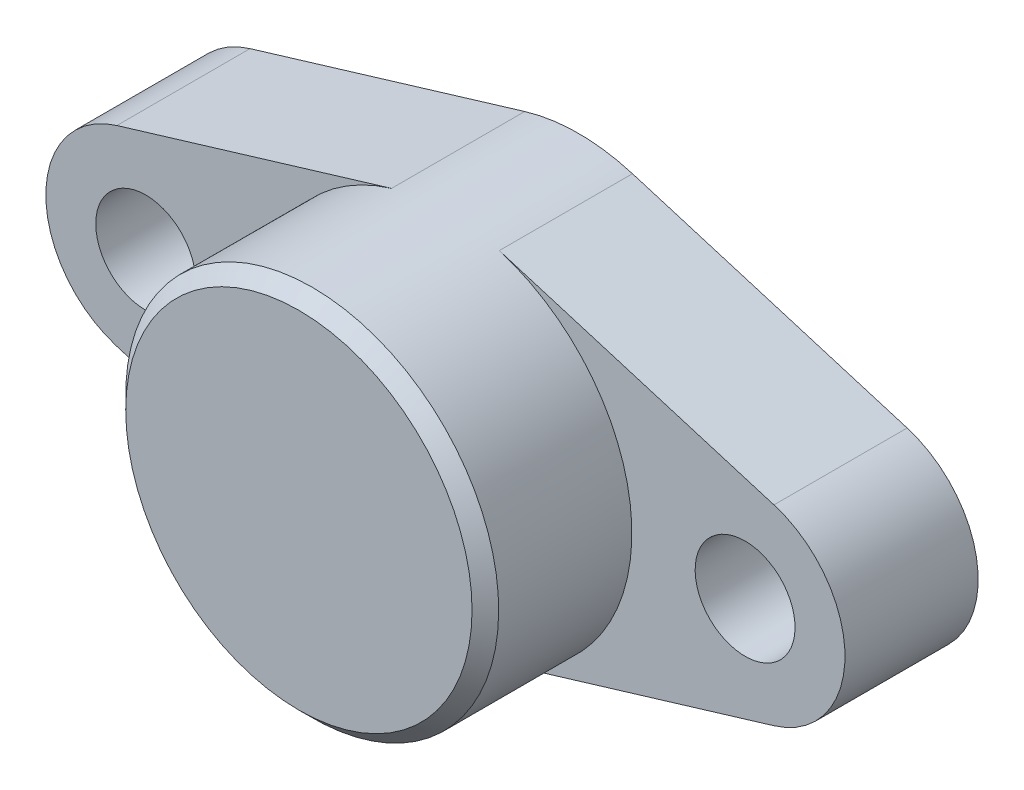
ISO-10303-21;
HEADER;
FILE_DESCRIPTION(('STEP AP214'),'2;1');
FILE_NAME('part.step','',(''),(''),'','','');
FILE_SCHEMA(('AUTOMOTIVE_DESIGN { 1 0 10303 214 1 1 1 1 }'));
ENDSEC;
DATA;
#1=APPLICATION_CONTEXT('core data for automotive mechanical design processes');
#2=APPLICATION_PROTOCOL_DEFINITION('international standard','automotive_design',2000,#1);
#3=PRODUCT_CONTEXT('',#1,'mechanical');
#4=PRODUCT('Part','Part','',(#3));
#5=PRODUCT_RELATED_PRODUCT_CATEGORY('part','',(#4));
#6=PRODUCT_DEFINITION_FORMATION('','',#4);
#7=PRODUCT_DEFINITION_CONTEXT('part definition',#1,'design');
#8=PRODUCT_DEFINITION('design','',#6,#7);
#9=PRODUCT_DEFINITION_SHAPE('','',#8);
#10=(LENGTH_UNIT() NAMED_UNIT(*) SI_UNIT(.MILLI.,.METRE.));
#11=(NAMED_UNIT(*) PLANE_ANGLE_UNIT() SI_UNIT($,.RADIAN.));
#12=(NAMED_UNIT(*) SI_UNIT($,.STERADIAN.) SOLID_ANGLE_UNIT());
#13=UNCERTAINTY_MEASURE_WITH_UNIT(LENGTH_MEASURE(1.E-05),#10,'distance_accuracy_value','');
#14=(GEOMETRIC_REPRESENTATION_CONTEXT(3) GLOBAL_UNCERTAINTY_ASSIGNED_CONTEXT((#13)) GLOBAL_UNIT_ASSIGNED_CONTEXT((#10,
#11,#12)) REPRESENTATION_CONTEXT('',''));
#15=CARTESIAN_POINT('',(0.,0.,0.));
#16=DIRECTION('',(0.,0.,1.));
#17=DIRECTION('',(1.,0.,0.));
#18=AXIS2_PLACEMENT_3D('',#15,#16,#17);
#19=CARTESIAN_POINT('',(22.5,0.,10.));
#20=DIRECTION('',(0.,0.,1.));
#21=DIRECTION('',(0.,1.,0.));
#22=AXIS2_PLACEMENT_3D('',#19,#20,#21);
#23=PLANE('',#22);
#24=CARTESIAN_POINT('',(0.,0.,10.));
#25=DIRECTION('',(0.,0.,1.));
#26=DIRECTION('',(0.,1.,0.));
#27=AXIS2_PLACEMENT_3D('',#24,#25,#26);
#28=CIRCLE('',#27,3.75);
#29=CARTESIAN_POINT('',(0.,3.75,10.));
#30=VERTEX_POINT('',#29);
#31=EDGE_CURVE('E88',#30,#30,#28,.T.);
#32=ORIENTED_EDGE('',*,*,#31,.F.);
#33=EDGE_LOOP('',(#32));
#34=FACE_BOUND('',#33,.T.);
#35=CARTESIAN_POINT('',(22.5,0.,10.));
#36=DIRECTION('',(0.,0.,1.));
#37=DIRECTION('',(0.,1.,0.));
#38=AXIS2_PLACEMENT_3D('',#35,#36,#37);
#39=CIRCLE('',#38,14.);
#40=CARTESIAN_POINT('',(18.4555555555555,13.4030768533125,10.));
#41=VERTEX_POINT('',#40);
#42=CARTESIAN_POINT('',(18.4555555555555,-13.4030768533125,10.));
#43=VERTEX_POINT('',#42);
#44=EDGE_CURVE('E80',#41,#43,#39,.T.);
#45=ORIENTED_EDGE('',*,*,#44,.F.);
#46=DIRECTION('',(0.957362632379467,0.288888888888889,0.));
#47=VECTOR('',#46,1.);
#48=CARTESIAN_POINT('',(-2.16666666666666,7.18021974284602,10.));
#49=LINE('',#48,#47);
#50=CARTESIAN_POINT('',(-2.16666666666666,7.18021974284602,10.));
#51=VERTEX_POINT('',#50);
#52=EDGE_CURVE('E82',#51,#41,#49,.T.);
#53=ORIENTED_EDGE('',*,*,#52,.F.);
#54=CARTESIAN_POINT('',(0.,0.,10.));
#55=DIRECTION('',(0.,0.,1.));
#56=DIRECTION('',(0.,1.,0.));
#57=AXIS2_PLACEMENT_3D('',#54,#55,#56);
#58=CIRCLE('',#57,7.5);
#59=CARTESIAN_POINT('',(-2.16666666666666,-7.18021974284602,10.));
#60=VERTEX_POINT('',#59);
#61=EDGE_CURVE('E99',#51,#60,#58,.T.);
#62=ORIENTED_EDGE('',*,*,#61,.T.);
#63=DIRECTION('',(0.957362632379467,-0.288888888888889,0.));
#64=VECTOR('',#63,1.);
#65=CARTESIAN_POINT('',(-2.16666666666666,-7.18021974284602,10.));
#66=LINE('',#65,#64);
#67=EDGE_CURVE('E84',#60,#43,#66,.T.);
#68=ORIENTED_EDGE('',*,*,#67,.T.);
#69=EDGE_LOOP('',(#45,#53,#62,#68));
#70=FACE_BOUND('',#69,.T.);
#71=ADVANCED_FACE('F14',(#34,#70),#23,.T.);
#72=CARTESIAN_POINT('',(45.,0.,10.));
#73=DIRECTION('',(0.,0.,1.));
#74=DIRECTION('',(0.,1.,0.));
#75=AXIS2_PLACEMENT_3D('',#72,#73,#74);
#76=CIRCLE('',#75,3.75);
#77=CARTESIAN_POINT('',(45.,3.75,10.));
#78=VERTEX_POINT('',#77);
#79=EDGE_CURVE('E176',#78,#78,#76,.T.);
#80=ORIENTED_EDGE('',*,*,#79,.F.);
#81=EDGE_LOOP('',(#80));
#82=FACE_BOUND('',#81,.T.);
#83=CARTESIAN_POINT('',(26.5444444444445,-13.4030768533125,10.));
#84=VERTEX_POINT('',#83);
#85=CARTESIAN_POINT('',(26.5444444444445,13.4030768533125,10.));
#86=VERTEX_POINT('',#85);
#87=EDGE_CURVE('E120',#84,#86,#39,.T.);
#88=ORIENTED_EDGE('',*,*,#87,.F.);
#89=DIRECTION('',(-0.957362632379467,-0.288888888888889,0.));
#90=VECTOR('',#89,1.);
#91=CARTESIAN_POINT('',(47.1666666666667,-7.18021974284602,10.));
#92=LINE('',#91,#90);
#93=CARTESIAN_POINT('',(47.1666666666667,-7.18021974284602,10.));
#94=VERTEX_POINT('',#93);
#95=EDGE_CURVE('E124',#94,#84,#92,.T.);
#96=ORIENTED_EDGE('',*,*,#95,.F.);
#97=CARTESIAN_POINT('',(45.,0.,10.));
#98=DIRECTION('',(0.,0.,-1.));
#99=DIRECTION('',(0.,-1.,0.));
#100=AXIS2_PLACEMENT_3D('',#97,#98,#99);
#101=CIRCLE('',#100,7.5);
#102=CARTESIAN_POINT('',(47.1666666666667,7.18021974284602,10.));
#103=VERTEX_POINT('',#102);
#104=EDGE_CURVE('E104',#103,#94,#101,.T.);
#105=ORIENTED_EDGE('',*,*,#104,.F.);
#106=DIRECTION('',(-0.957362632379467,0.288888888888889,0.));
#107=VECTOR('',#106,1.);
#108=CARTESIAN_POINT('',(47.1666666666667,7.18021974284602,10.));
#109=LINE('',#108,#107);
#110=EDGE_CURVE('E100',#103,#86,#109,.T.);
#111=ORIENTED_EDGE('',*,*,#110,.T.);
#112=EDGE_LOOP('',(#88,#96,#105,#111));
#113=FACE_BOUND('',#112,.T.);
#114=ADVANCED_FACE('F188',(#82,#113),#23,.T.);
#115=CARTESIAN_POINT('',(22.5,0.,0.));
#116=DIRECTION('',(0.,0.,1.));
#117=DIRECTION('',(0.,1.,0.));
#118=AXIS2_PLACEMENT_3D('',#115,#116,#117);
#119=PLANE('',#118);
#120=CARTESIAN_POINT('',(45.,0.,0.));
#121=DIRECTION('',(0.,0.,-1.));
#122=DIRECTION('',(0.,1.,0.));
#123=AXIS2_PLACEMENT_3D('',#120,#121,#122);
#124=CIRCLE('',#123,3.75);
#125=CARTESIAN_POINT('',(45.,3.75,0.));
#126=VERTEX_POINT('',#125);
#127=EDGE_CURVE('E179',#126,#126,#124,.T.);
#128=ORIENTED_EDGE('',*,*,#127,.F.);
#129=EDGE_LOOP('',(#128));
#130=FACE_BOUND('',#129,.T.);
#131=CARTESIAN_POINT('',(0.,0.,0.));
#132=DIRECTION('',(0.,0.,-1.));
#133=DIRECTION('',(0.,-1.,0.));
#134=AXIS2_PLACEMENT_3D('',#131,#132,#133);
#135=CIRCLE('',#134,3.75);
#136=CARTESIAN_POINT('',(0.,-3.75,0.));
#137=VERTEX_POINT('',#136);
#138=EDGE_CURVE('E173',#137,#137,#135,.T.);
#139=ORIENTED_EDGE('',*,*,#138,.F.);
#140=EDGE_LOOP('',(#139));
#141=FACE_BOUND('',#140,.T.);
#142=CARTESIAN_POINT('',(22.5,0.,0.));
#143=DIRECTION('',(0.,0.,1.));
#144=DIRECTION('',(0.,1.,0.));
#145=AXIS2_PLACEMENT_3D('',#142,#143,#144);
#146=CIRCLE('',#145,14.);
#147=CARTESIAN_POINT('',(18.4555555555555,-13.4030768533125,0.));
#148=VERTEX_POINT('',#147);
#149=CARTESIAN_POINT('',(26.5444444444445,-13.4030768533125,0.));
#150=VERTEX_POINT('',#149);
#151=EDGE_CURVE('E87',#148,#150,#146,.T.);
#152=ORIENTED_EDGE('',*,*,#151,.F.);
#153=DIRECTION('',(0.957362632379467,-0.288888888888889,0.));
#154=VECTOR('',#153,1.);
#155=CARTESIAN_POINT('',(-2.16666666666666,-7.18021974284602,0.));
#156=LINE('',#155,#154);
#157=CARTESIAN_POINT('',(-2.16666666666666,-7.18021974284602,0.));
#158=VERTEX_POINT('',#157);
#159=EDGE_CURVE('E127',#158,#148,#156,.T.);
#160=ORIENTED_EDGE('',*,*,#159,.F.);
#161=CARTESIAN_POINT('',(0.,0.,0.));
#162=DIRECTION('',(0.,0.,1.));
#163=DIRECTION('',(0.,1.,0.));
#164=AXIS2_PLACEMENT_3D('',#161,#162,#163);
#165=CIRCLE('',#164,7.5);
#166=CARTESIAN_POINT('',(-2.16666666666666,7.18021974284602,0.));
#167=VERTEX_POINT('',#166);
#168=EDGE_CURVE('E156',#167,#158,#165,.T.);
#169=ORIENTED_EDGE('',*,*,#168,.F.);
#170=DIRECTION('',(0.957362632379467,0.288888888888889,0.));
#171=VECTOR('',#170,1.);
#172=CARTESIAN_POINT('',(-2.16666666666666,7.18021974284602,0.));
#173=LINE('',#172,#171);
#174=CARTESIAN_POINT('',(18.4555555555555,13.4030768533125,0.));
#175=VERTEX_POINT('',#174);
#176=EDGE_CURVE('E158',#167,#175,#173,.T.);
#177=ORIENTED_EDGE('',*,*,#176,.T.);
#178=CARTESIAN_POINT('',(22.5,0.,0.));
#179=DIRECTION('',(0.,0.,-1.));
#180=DIRECTION('',(0.,-1.,0.));
#181=AXIS2_PLACEMENT_3D('',#178,#179,#180);
#182=CIRCLE('',#181,14.);
#183=CARTESIAN_POINT('',(26.5444444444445,13.4030768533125,0.));
#184=VERTEX_POINT('',#183);
#185=EDGE_CURVE('E94',#175,#184,#182,.T.);
#186=ORIENTED_EDGE('',*,*,#185,.T.);
#187=DIRECTION('',(-0.957362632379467,0.288888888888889,0.));
#188=VECTOR('',#187,1.);
#189=CARTESIAN_POINT('',(47.1666666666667,7.18021974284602,0.));
#190=LINE('',#189,#188);
#191=CARTESIAN_POINT('',(47.1666666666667,7.18021974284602,0.));
#192=VERTEX_POINT('',#191);
#193=EDGE_CURVE('E161',#192,#184,#190,.T.);
#194=ORIENTED_EDGE('',*,*,#193,.F.);
#195=CARTESIAN_POINT('',(45.,0.,0.));
#196=DIRECTION('',(0.,0.,-1.));
#197=DIRECTION('',(0.,-1.,0.));
#198=AXIS2_PLACEMENT_3D('',#195,#196,#197);
#199=CIRCLE('',#198,7.5);
#200=CARTESIAN_POINT('',(47.1666666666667,-7.18021974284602,0.));
#201=VERTEX_POINT('',#200);
#202=EDGE_CURVE('E163',#192,#201,#199,.T.);
#203=ORIENTED_EDGE('',*,*,#202,.T.);
#204=DIRECTION('',(-0.957362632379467,-0.288888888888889,0.));
#205=VECTOR('',#204,1.);
#206=CARTESIAN_POINT('',(47.1666666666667,-7.18021974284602,0.));
#207=LINE('',#206,#205);
#208=EDGE_CURVE('E166',#201,#150,#207,.T.);
#209=ORIENTED_EDGE('',*,*,#208,.T.);
#210=EDGE_LOOP('',(#152,#160,#169,#177,#186,#194,#203,#209));
#211=FACE_BOUND('',#210,.T.);
#212=ADVANCED_FACE('F185',(#130,#141,#211),#119,.F.);
#213=CARTESIAN_POINT('',(47.1666666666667,-7.18021974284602,10.));
#214=DIRECTION('',(0.288888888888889,-0.957362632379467,0.));
#215=DIRECTION('',(0.957362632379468,0.288888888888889,0.));
#216=AXIS2_PLACEMENT_3D('',#213,#214,#215);
#217=PLANE('',#216);
#218=DIRECTION('',(0.,0.,-1.));
#219=VECTOR('',#218,1.);
#220=CARTESIAN_POINT('',(47.1666666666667,-7.18021974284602,10.));
#221=LINE('',#220,#219);
#222=EDGE_CURVE('E121',#94,#201,#221,.T.);
#223=ORIENTED_EDGE('',*,*,#222,.F.);
#224=ORIENTED_EDGE('',*,*,#95,.T.);
#225=DIRECTION('',(0.,0.,-1.));
#226=VECTOR('',#225,1.);
#227=CARTESIAN_POINT('',(26.5444444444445,-13.4030768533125,10.));
#228=LINE('',#227,#226);
#229=EDGE_CURVE('E118',#84,#150,#228,.T.);
#230=ORIENTED_EDGE('',*,*,#229,.T.);
#231=ORIENTED_EDGE('',*,*,#208,.F.);
#232=EDGE_LOOP('',(#223,#224,#230,#231));
#233=FACE_BOUND('',#232,.T.);
#234=ADVANCED_FACE('F16',(#233),#217,.T.);
#235=CARTESIAN_POINT('',(45.,0.,10.));
#236=DIRECTION('',(0.,0.,-1.));
#237=DIRECTION('',(0.,-1.,0.));
#238=AXIS2_PLACEMENT_3D('',#235,#236,#237);
#239=CYLINDRICAL_SURFACE('',#238,7.5);
#240=DIRECTION('',(0.,0.,-1.));
#241=VECTOR('',#240,1.);
#242=CARTESIAN_POINT('',(47.1666666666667,7.18021974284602,10.));
#243=LINE('',#242,#241);
#244=EDGE_CURVE('E140',#103,#192,#243,.T.);
#245=ORIENTED_EDGE('',*,*,#244,.F.);
#246=ORIENTED_EDGE('',*,*,#104,.T.);
#247=ORIENTED_EDGE('',*,*,#222,.T.);
#248=ORIENTED_EDGE('',*,*,#202,.F.);
#249=EDGE_LOOP('',(#245,#246,#247,#248));
#250=FACE_BOUND('',#249,.T.);
#251=ADVANCED_FACE('F205',(#250),#239,.T.);
#252=CARTESIAN_POINT('',(47.1666666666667,7.18021974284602,10.));
#253=DIRECTION('',(-0.288888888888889,-0.957362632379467,0.));
#254=DIRECTION('',(0.957362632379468,-0.288888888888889,0.));
#255=AXIS2_PLACEMENT_3D('',#252,#253,#254);
#256=PLANE('',#255);
#257=DIRECTION('',(0.,0.,-1.));
#258=VECTOR('',#257,1.);
#259=CARTESIAN_POINT('',(26.5444444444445,13.4030768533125,10.));
#260=LINE('',#259,#258);
#261=EDGE_CURVE('E96',#86,#184,#260,.T.);
#262=ORIENTED_EDGE('',*,*,#261,.F.);
#263=ORIENTED_EDGE('',*,*,#110,.F.);
#264=ORIENTED_EDGE('',*,*,#244,.T.);
#265=ORIENTED_EDGE('',*,*,#193,.T.);
#266=EDGE_LOOP('',(#262,#263,#264,#265));
#267=FACE_BOUND('',#266,.T.);
#268=ADVANCED_FACE('F200',(#267),#256,.F.);
#269=CARTESIAN_POINT('',(22.5,0.,10.));
#270=DIRECTION('',(0.,0.,-1.));
#271=DIRECTION('',(0.,-1.,0.));
#272=AXIS2_PLACEMENT_3D('',#269,#270,#271);
#273=CYLINDRICAL_SURFACE('',#272,14.);
#274=CARTESIAN_POINT('',(22.5,0.,20.));
#275=DIRECTION('',(0.,0.,1.));
#276=DIRECTION('',(0.,1.,0.));
#277=AXIS2_PLACEMENT_3D('',#274,#275,#276);
#278=CIRCLE('',#277,14.);
#279=CARTESIAN_POINT('',(22.5,14.,20.));
#280=VERTEX_POINT('',#279);
#281=EDGE_CURVE('E9',#280,#280,#278,.F.);
#282=ORIENTED_EDGE('',*,*,#281,.T.);
#283=EDGE_LOOP('',(#282));
#284=FACE_BOUND('',#283,.T.);
#285=DIRECTION('',(0.,0.,-1.));
#286=VECTOR('',#285,1.);
#287=CARTESIAN_POINT('',(18.4555555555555,13.4030768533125,10.));
#288=LINE('',#287,#286);
#289=EDGE_CURVE('E91',#41,#175,#288,.T.);
#290=ORIENTED_EDGE('',*,*,#289,.F.);
#291=ORIENTED_EDGE('',*,*,#44,.T.);
#292=DIRECTION('',(0.,0.,-1.));
#293=VECTOR('',#292,1.);
#294=CARTESIAN_POINT('',(18.4555555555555,-13.4030768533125,10.));
#295=LINE('',#294,#293);
#296=EDGE_CURVE('E111',#43,#148,#295,.T.);
#297=ORIENTED_EDGE('',*,*,#296,.T.);
#298=ORIENTED_EDGE('',*,*,#151,.T.);
#299=ORIENTED_EDGE('',*,*,#229,.F.);
#300=ORIENTED_EDGE('',*,*,#87,.T.);
#301=ORIENTED_EDGE('',*,*,#261,.T.);
#302=ORIENTED_EDGE('',*,*,#185,.F.);
#303=EDGE_LOOP('',(#290,#291,#297,#298,#299,#300,#301,#302));
#304=FACE_BOUND('',#303,.T.);
#305=ADVANCED_FACE('F92',(#284,#304),#273,.T.);
#306=CARTESIAN_POINT('',(-2.16666666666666,7.18021974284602,10.));
#307=DIRECTION('',(-0.288888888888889,0.957362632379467,0.));
#308=DIRECTION('',(-0.957362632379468,-0.288888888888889,0.));
#309=AXIS2_PLACEMENT_3D('',#306,#307,#308);
#310=PLANE('',#309);
#311=DIRECTION('',(0.,0.,-1.));
#312=VECTOR('',#311,1.);
#313=CARTESIAN_POINT('',(-2.16666666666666,7.18021974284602,10.));
#314=LINE('',#313,#312);
#315=EDGE_CURVE('E37',#51,#167,#314,.T.);
#316=ORIENTED_EDGE('',*,*,#315,.F.);
#317=ORIENTED_EDGE('',*,*,#52,.T.);
#318=ORIENTED_EDGE('',*,*,#289,.T.);
#319=ORIENTED_EDGE('',*,*,#176,.F.);
#320=EDGE_LOOP('',(#316,#317,#318,#319));
#321=FACE_BOUND('',#320,.T.);
#322=ADVANCED_FACE('F98',(#321),#310,.T.);
#323=CARTESIAN_POINT('',(0.,0.,10.));
#324=DIRECTION('',(0.,0.,-1.));
#325=DIRECTION('',(0.,-1.,0.));
#326=AXIS2_PLACEMENT_3D('',#323,#324,#325);
#327=CYLINDRICAL_SURFACE('',#326,7.5);
#328=DIRECTION('',(0.,0.,-1.));
#329=VECTOR('',#328,1.);
#330=CARTESIAN_POINT('',(-2.16666666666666,-7.18021974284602,10.));
#331=LINE('',#330,#329);
#332=EDGE_CURVE('E29',#60,#158,#331,.T.);
#333=ORIENTED_EDGE('',*,*,#332,.F.);
#334=ORIENTED_EDGE('',*,*,#61,.F.);
#335=ORIENTED_EDGE('',*,*,#315,.T.);
#336=ORIENTED_EDGE('',*,*,#168,.T.);
#337=EDGE_LOOP('',(#333,#334,#335,#336));
#338=FACE_BOUND('',#337,.T.);
#339=ADVANCED_FACE('F198',(#338),#327,.T.);
#340=CARTESIAN_POINT('',(-2.16666666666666,-7.18021974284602,10.));
#341=DIRECTION('',(0.288888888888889,0.957362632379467,0.));
#342=DIRECTION('',(-0.957362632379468,0.288888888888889,0.));
#343=AXIS2_PLACEMENT_3D('',#340,#341,#342);
#344=PLANE('',#343);
#345=ORIENTED_EDGE('',*,*,#67,.F.);
#346=ORIENTED_EDGE('',*,*,#332,.T.);
#347=ORIENTED_EDGE('',*,*,#159,.T.);
#348=ORIENTED_EDGE('',*,*,#296,.F.);
#349=EDGE_LOOP('',(#345,#346,#347,#348));
#350=FACE_BOUND('',#349,.T.);
#351=ADVANCED_FACE('F197',(#350),#344,.F.);
#352=CARTESIAN_POINT('',(22.5,0.,21.));
#353=DIRECTION('',(0.,0.,1.));
#354=DIRECTION('',(0.,1.,0.));
#355=AXIS2_PLACEMENT_3D('',#352,#353,#354);
#356=PLANE('',#355);
#357=CARTESIAN_POINT('',(22.5,0.,21.));
#358=DIRECTION('',(0.,0.,1.));
#359=DIRECTION('',(0.,1.,0.));
#360=AXIS2_PLACEMENT_3D('',#357,#358,#359);
#361=CIRCLE('',#360,13.);
#362=CARTESIAN_POINT('',(22.5,13.,21.));
#363=VERTEX_POINT('',#362);
#364=EDGE_CURVE('E22',#363,#363,#361,.T.);
#365=ORIENTED_EDGE('',*,*,#364,.T.);
#366=EDGE_LOOP('',(#365));
#367=FACE_BOUND('',#366,.T.);
#368=ADVANCED_FACE('F226',(#367),#356,.T.);
#369=CARTESIAN_POINT('',(22.5,0.,21.));
#370=DIRECTION('',(0.,0.,-1.));
#371=DIRECTION('',(0.,-1.,0.));
#372=AXIS2_PLACEMENT_3D('',#369,#370,#371);
#373=CONICAL_SURFACE('',#372,13.,0.785398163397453);
#374=ORIENTED_EDGE('',*,*,#281,.F.);
#375=EDGE_LOOP('',(#374));
#376=FACE_BOUND('',#375,.T.);
#377=ORIENTED_EDGE('',*,*,#364,.F.);
#378=EDGE_LOOP('',(#377));
#379=FACE_BOUND('',#378,.T.);
#380=ADVANCED_FACE('F272',(#376,#379),#373,.T.);
#381=CARTESIAN_POINT('',(0.,0.,21.));
#382=DIRECTION('',(0.,0.,-1.));
#383=DIRECTION('',(0.,-1.,0.));
#384=AXIS2_PLACEMENT_3D('',#381,#382,#383);
#385=CYLINDRICAL_SURFACE('',#384,3.75);
#386=ORIENTED_EDGE('',*,*,#31,.T.);
#387=EDGE_LOOP('',(#386));
#388=FACE_BOUND('',#387,.T.);
#389=ORIENTED_EDGE('',*,*,#138,.T.);
#390=EDGE_LOOP('',(#389));
#391=FACE_BOUND('',#390,.T.);
#392=ADVANCED_FACE('F279',(#388,#391),#385,.F.);
#393=CARTESIAN_POINT('',(45.,0.,21.));
#394=DIRECTION('',(0.,0.,-1.));
#395=DIRECTION('',(0.,-1.,0.));
#396=AXIS2_PLACEMENT_3D('',#393,#394,#395);
#397=CYLINDRICAL_SURFACE('',#396,3.75);
#398=ORIENTED_EDGE('',*,*,#79,.T.);
#399=EDGE_LOOP('',(#398));
#400=FACE_BOUND('',#399,.T.);
#401=ORIENTED_EDGE('',*,*,#127,.T.);
#402=EDGE_LOOP('',(#401));
#403=FACE_BOUND('',#402,.T.);
#404=ADVANCED_FACE('F183',(#400,#403),#397,.F.);
#405=CLOSED_SHELL('',(#71,#114,#212,#234,#251,#268,#305,#322,#339,#351,#368,#380,#392,#404));
#406=MANIFOLD_SOLID_BREP('B1',#405);
#407=ADVANCED_BREP_SHAPE_REPRESENTATION('',(#18,#406),#14);
#408=SHAPE_DEFINITION_REPRESENTATION(#9,#407);
ENDSEC;
END-ISO-10303-21;
